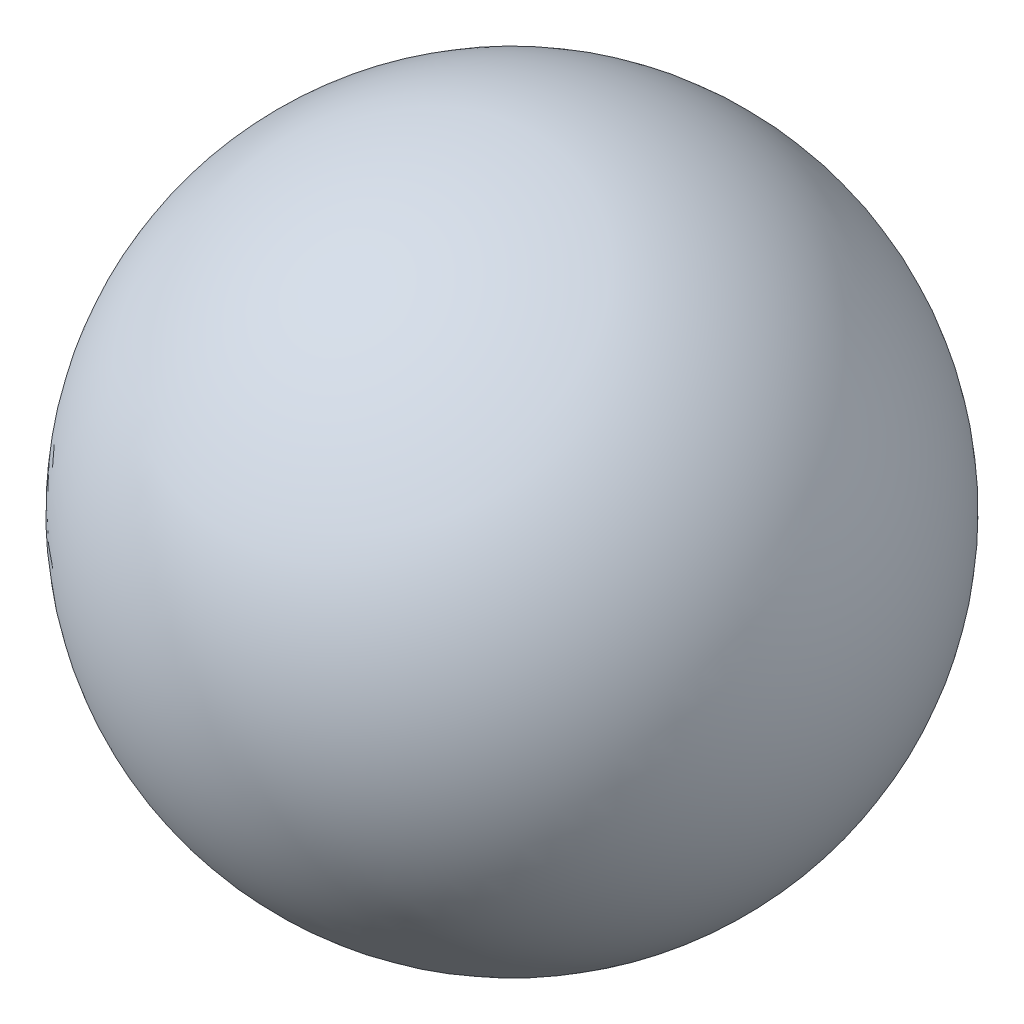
ISO-10303-21;
HEADER;
FILE_DESCRIPTION(('STEP AP214'),'2;1');
FILE_NAME('part.step','',(''),(''),'','','');
FILE_SCHEMA(('AUTOMOTIVE_DESIGN { 1 0 10303 214 1 1 1 1 }'));
ENDSEC;
DATA;
#1=APPLICATION_CONTEXT('core data for automotive mechanical design processes');
#2=APPLICATION_PROTOCOL_DEFINITION('international standard','automotive_design',2000,#1);
#3=PRODUCT_CONTEXT('',#1,'mechanical');
#4=PRODUCT('Part','Part','',(#3));
#5=PRODUCT_RELATED_PRODUCT_CATEGORY('part','',(#4));
#6=PRODUCT_DEFINITION_FORMATION('','',#4);
#7=PRODUCT_DEFINITION_CONTEXT('part definition',#1,'design');
#8=PRODUCT_DEFINITION('design','',#6,#7);
#9=PRODUCT_DEFINITION_SHAPE('','',#8);
#10=(LENGTH_UNIT() NAMED_UNIT(*) SI_UNIT(.MILLI.,.METRE.));
#11=(NAMED_UNIT(*) PLANE_ANGLE_UNIT() SI_UNIT($,.RADIAN.));
#12=(NAMED_UNIT(*) SI_UNIT($,.STERADIAN.) SOLID_ANGLE_UNIT());
#13=UNCERTAINTY_MEASURE_WITH_UNIT(LENGTH_MEASURE(1.E-05),#10,'distance_accuracy_value','');
#14=(GEOMETRIC_REPRESENTATION_CONTEXT(3) GLOBAL_UNCERTAINTY_ASSIGNED_CONTEXT((#13)) GLOBAL_UNIT_ASSIGNED_CONTEXT((#10,
#11,#12)) REPRESENTATION_CONTEXT('',''));
#15=CARTESIAN_POINT('',(0.,0.,0.));
#16=DIRECTION('',(0.,0.,1.));
#17=DIRECTION('',(1.,0.,0.));
#18=AXIS2_PLACEMENT_3D('',#15,#16,#17);
#19=CARTESIAN_POINT('',(4.5,7.07106781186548,-7.07106781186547));
#20=DIRECTION('',(0.046663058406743,0.885766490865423,0.461779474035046));
#21=DIRECTION('',(-0.726900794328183,-0.286970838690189,0.623909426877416));
#22=AXIS2_PLACEMENT_3D('',#19,#20,#21);
#23=SPHERICAL_SURFACE('',#22,3.);
#24=CARTESIAN_POINT('',(4.36001082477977,4.41376833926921,-8.45640623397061));
#25=VERTEX_POINT('',#24);
#26=VERTEX_LOOP('',#25);
#27=FACE_BOUND('',#26,.T.);
#28=CARTESIAN_POINT('',(4.63998917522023,9.72836728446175,-5.68572938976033));
#29=VERTEX_POINT('',#28);
#30=VERTEX_LOOP('',#29);
#31=FACE_BOUND('',#30,.T.);
#32=ADVANCED_FACE('F16',(#27,#31),#23,.T.);
#33=CLOSED_SHELL('',(#32));
#34=MANIFOLD_SOLID_BREP('B1',#33);
#35=ADVANCED_BREP_SHAPE_REPRESENTATION('',(#18,#34),#14);
#36=SHAPE_DEFINITION_REPRESENTATION(#9,#35);
ENDSEC;
END-ISO-10303-21;
